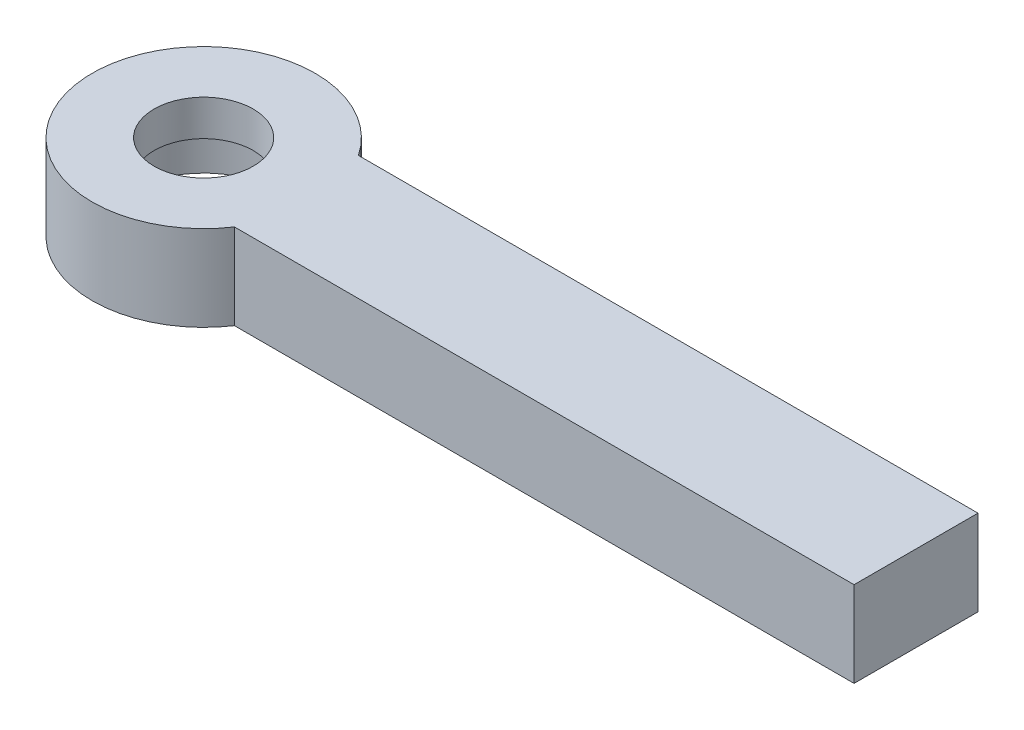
ISO-10303-21;
HEADER;
FILE_DESCRIPTION(('STEP AP214'),'2;1');
FILE_NAME('part.step','',(''),(''),'','','');
FILE_SCHEMA(('AUTOMOTIVE_DESIGN { 1 0 10303 214 1 1 1 1 }'));
ENDSEC;
DATA;
#1=APPLICATION_CONTEXT('core data for automotive mechanical design processes');
#2=APPLICATION_PROTOCOL_DEFINITION('international standard','automotive_design',2000,#1);
#3=PRODUCT_CONTEXT('',#1,'mechanical');
#4=PRODUCT('Part','Part','',(#3));
#5=PRODUCT_RELATED_PRODUCT_CATEGORY('part','',(#4));
#6=PRODUCT_DEFINITION_FORMATION('','',#4);
#7=PRODUCT_DEFINITION_CONTEXT('part definition',#1,'design');
#8=PRODUCT_DEFINITION('design','',#6,#7);
#9=PRODUCT_DEFINITION_SHAPE('','',#8);
#10=(LENGTH_UNIT() NAMED_UNIT(*) SI_UNIT(.MILLI.,.METRE.));
#11=(NAMED_UNIT(*) PLANE_ANGLE_UNIT() SI_UNIT($,.RADIAN.));
#12=(NAMED_UNIT(*) SI_UNIT($,.STERADIAN.) SOLID_ANGLE_UNIT());
#13=UNCERTAINTY_MEASURE_WITH_UNIT(LENGTH_MEASURE(1.E-05),#10,'distance_accuracy_value','');
#14=(GEOMETRIC_REPRESENTATION_CONTEXT(3) GLOBAL_UNCERTAINTY_ASSIGNED_CONTEXT((#13)) GLOBAL_UNIT_ASSIGNED_CONTEXT((#10,
#11,#12)) REPRESENTATION_CONTEXT('',''));
#15=CARTESIAN_POINT('',(0.,0.,0.));
#16=DIRECTION('',(0.,0.,1.));
#17=DIRECTION('',(1.,0.,0.));
#18=AXIS2_PLACEMENT_3D('',#15,#16,#17);
#19=CARTESIAN_POINT('',(0.,8.763,0.));
#20=DIRECTION('',(0.,-1.,0.));
#21=DIRECTION('',(0.,0.,-1.));
#22=AXIS2_PLACEMENT_3D('',#19,#20,#21);
#23=CYLINDRICAL_SURFACE('',#22,5.08);
#24=CARTESIAN_POINT('',(0.,8.763,0.));
#25=DIRECTION('',(0.,1.,0.));
#26=DIRECTION('',(0.,0.,1.));
#27=AXIS2_PLACEMENT_3D('',#24,#25,#26);
#28=CIRCLE('',#27,5.08);
#29=CARTESIAN_POINT('',(0.,8.763,5.08));
#30=VERTEX_POINT('',#29);
#31=EDGE_CURVE('E102',#30,#30,#28,.T.);
#32=ORIENTED_EDGE('',*,*,#31,.T.);
#33=EDGE_LOOP('',(#32));
#34=FACE_BOUND('',#33,.T.);
#35=CARTESIAN_POINT('',(0.,5.08,0.));
#36=DIRECTION('',(0.,-1.,0.));
#37=DIRECTION('',(0.,0.,-1.));
#38=AXIS2_PLACEMENT_3D('',#35,#36,#37);
#39=CIRCLE('',#38,5.08);
#40=CARTESIAN_POINT('',(0.,5.08,-5.08));
#41=VERTEX_POINT('',#40);
#42=EDGE_CURVE('E36',#41,#41,#39,.T.);
#43=ORIENTED_EDGE('',*,*,#42,.T.);
#44=EDGE_LOOP('',(#43));
#45=FACE_BOUND('',#44,.T.);
#46=ADVANCED_FACE('F32',(#34,#45),#23,.F.);
#47=CARTESIAN_POINT('',(0.,8.763,0.));
#48=DIRECTION('',(0.,-1.,0.));
#49=DIRECTION('',(0.,0.,-1.));
#50=AXIS2_PLACEMENT_3D('',#47,#48,#49);
#51=PLANE('',#50);
#52=CARTESIAN_POINT('',(0.,8.763,0.));
#53=DIRECTION('',(0.,1.,0.));
#54=DIRECTION('',(0.,0.,-1.));
#55=AXIS2_PLACEMENT_3D('',#52,#53,#54);
#56=CIRCLE('',#55,11.43);
#57=CARTESIAN_POINT('',(9.50380976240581,8.763,-6.35));
#58=VERTEX_POINT('',#57);
#59=CARTESIAN_POINT('',(9.50380976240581,8.763,6.35));
#60=VERTEX_POINT('',#59);
#61=EDGE_CURVE('E86',#58,#60,#56,.T.);
#62=ORIENTED_EDGE('',*,*,#61,.T.);
#63=DIRECTION('',(1.,0.,0.));
#64=VECTOR('',#63,1.);
#65=CARTESIAN_POINT('',(9.50380976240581,8.763,6.35));
#66=LINE('',#65,#64);
#67=CARTESIAN_POINT('',(73.0038097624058,8.763,6.35));
#68=VERTEX_POINT('',#67);
#69=EDGE_CURVE('E80',#60,#68,#66,.T.);
#70=ORIENTED_EDGE('',*,*,#69,.T.);
#71=DIRECTION('',(0.,0.,-1.));
#72=VECTOR('',#71,1.);
#73=CARTESIAN_POINT('',(73.0038097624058,8.763,6.35));
#74=LINE('',#73,#72);
#75=CARTESIAN_POINT('',(73.0038097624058,8.763,-6.35));
#76=VERTEX_POINT('',#75);
#77=EDGE_CURVE('E84',#68,#76,#74,.T.);
#78=ORIENTED_EDGE('',*,*,#77,.T.);
#79=DIRECTION('',(-1.,0.,0.));
#80=VECTOR('',#79,1.);
#81=CARTESIAN_POINT('',(73.0038097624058,8.763,-6.35));
#82=LINE('',#81,#80);
#83=EDGE_CURVE('E50',#76,#58,#82,.T.);
#84=ORIENTED_EDGE('',*,*,#83,.T.);
#85=EDGE_LOOP('',(#62,#70,#78,#84));
#86=FACE_BOUND('',#85,.T.);
#87=ORIENTED_EDGE('',*,*,#31,.F.);
#88=EDGE_LOOP('',(#87));
#89=FACE_BOUND('',#88,.T.);
#90=ADVANCED_FACE('F81',(#86,#89),#51,.F.);
#91=CARTESIAN_POINT('',(0.,0.,0.));
#92=DIRECTION('',(0.,-1.,0.));
#93=DIRECTION('',(0.,0.,-1.));
#94=AXIS2_PLACEMENT_3D('',#91,#92,#93);
#95=PLANE('',#94);
#96=CARTESIAN_POINT('',(0.,0.,0.));
#97=DIRECTION('',(0.,-1.,0.));
#98=DIRECTION('',(0.,0.,-1.));
#99=AXIS2_PLACEMENT_3D('',#96,#97,#98);
#100=CIRCLE('',#99,7.9375);
#101=CARTESIAN_POINT('',(0.,0.,-7.9375));
#102=VERTEX_POINT('',#101);
#103=EDGE_CURVE('E115',#102,#102,#100,.T.);
#104=ORIENTED_EDGE('',*,*,#103,.F.);
#105=EDGE_LOOP('',(#104));
#106=FACE_BOUND('',#105,.T.);
#107=CARTESIAN_POINT('',(0.,0.,0.));
#108=DIRECTION('',(0.,1.,0.));
#109=DIRECTION('',(0.,0.,-1.));
#110=AXIS2_PLACEMENT_3D('',#107,#108,#109);
#111=CIRCLE('',#110,11.43);
#112=CARTESIAN_POINT('',(9.50380976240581,0.,-6.35));
#113=VERTEX_POINT('',#112);
#114=CARTESIAN_POINT('',(9.50380976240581,0.,6.35));
#115=VERTEX_POINT('',#114);
#116=EDGE_CURVE('E99',#113,#115,#111,.T.);
#117=ORIENTED_EDGE('',*,*,#116,.F.);
#118=DIRECTION('',(-1.,0.,0.));
#119=VECTOR('',#118,1.);
#120=CARTESIAN_POINT('',(73.0038097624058,0.,-6.35));
#121=LINE('',#120,#119);
#122=CARTESIAN_POINT('',(73.0038097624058,0.,-6.35));
#123=VERTEX_POINT('',#122);
#124=EDGE_CURVE('E73',#123,#113,#121,.T.);
#125=ORIENTED_EDGE('',*,*,#124,.F.);
#126=DIRECTION('',(0.,0.,-1.));
#127=VECTOR('',#126,1.);
#128=CARTESIAN_POINT('',(73.0038097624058,0.,6.35));
#129=LINE('',#128,#127);
#130=CARTESIAN_POINT('',(73.0038097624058,0.,6.35));
#131=VERTEX_POINT('',#130);
#132=EDGE_CURVE('E67',#131,#123,#129,.T.);
#133=ORIENTED_EDGE('',*,*,#132,.F.);
#134=DIRECTION('',(1.,0.,0.));
#135=VECTOR('',#134,1.);
#136=CARTESIAN_POINT('',(9.50380976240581,0.,6.35));
#137=LINE('',#136,#135);
#138=EDGE_CURVE('E90',#115,#131,#137,.T.);
#139=ORIENTED_EDGE('',*,*,#138,.F.);
#140=EDGE_LOOP('',(#117,#125,#133,#139));
#141=FACE_BOUND('',#140,.T.);
#142=ADVANCED_FACE('F110',(#106,#141),#95,.T.);
#143=CARTESIAN_POINT('',(0.,8.763,0.));
#144=DIRECTION('',(0.,-1.,0.));
#145=DIRECTION('',(0.,0.,-1.));
#146=AXIS2_PLACEMENT_3D('',#143,#144,#145);
#147=CYLINDRICAL_SURFACE('',#146,11.43);
#148=ORIENTED_EDGE('',*,*,#116,.T.);
#149=DIRECTION('',(0.,-1.,0.));
#150=VECTOR('',#149,1.);
#151=CARTESIAN_POINT('',(9.50380976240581,8.763,6.35));
#152=LINE('',#151,#150);
#153=EDGE_CURVE('E11',#60,#115,#152,.T.);
#154=ORIENTED_EDGE('',*,*,#153,.F.);
#155=ORIENTED_EDGE('',*,*,#61,.F.);
#156=DIRECTION('',(0.,-1.,0.));
#157=VECTOR('',#156,1.);
#158=CARTESIAN_POINT('',(9.50380976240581,8.763,-6.35));
#159=LINE('',#158,#157);
#160=EDGE_CURVE('E95',#58,#113,#159,.T.);
#161=ORIENTED_EDGE('',*,*,#160,.T.);
#162=EDGE_LOOP('',(#148,#154,#155,#161));
#163=FACE_BOUND('',#162,.T.);
#164=ADVANCED_FACE('F34',(#163),#147,.T.);
#165=CARTESIAN_POINT('',(9.50380976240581,8.763,6.35));
#166=DIRECTION('',(0.,0.,-1.));
#167=DIRECTION('',(-1.,0.,0.));
#168=AXIS2_PLACEMENT_3D('',#165,#166,#167);
#169=PLANE('',#168);
#170=ORIENTED_EDGE('',*,*,#138,.T.);
#171=DIRECTION('',(0.,-1.,0.));
#172=VECTOR('',#171,1.);
#173=CARTESIAN_POINT('',(73.0038097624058,8.763,6.35));
#174=LINE('',#173,#172);
#175=EDGE_CURVE('E42',#68,#131,#174,.T.);
#176=ORIENTED_EDGE('',*,*,#175,.F.);
#177=ORIENTED_EDGE('',*,*,#69,.F.);
#178=ORIENTED_EDGE('',*,*,#153,.T.);
#179=EDGE_LOOP('',(#170,#176,#177,#178));
#180=FACE_BOUND('',#179,.T.);
#181=ADVANCED_FACE('F89',(#180),#169,.F.);
#182=CARTESIAN_POINT('',(73.0038097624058,8.763,6.35));
#183=DIRECTION('',(-1.,0.,0.));
#184=DIRECTION('',(0.,0.,1.));
#185=AXIS2_PLACEMENT_3D('',#182,#183,#184);
#186=PLANE('',#185);
#187=ORIENTED_EDGE('',*,*,#132,.T.);
#188=DIRECTION('',(0.,-1.,0.));
#189=VECTOR('',#188,1.);
#190=CARTESIAN_POINT('',(73.0038097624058,8.763,-6.35));
#191=LINE('',#190,#189);
#192=EDGE_CURVE('E91',#76,#123,#191,.T.);
#193=ORIENTED_EDGE('',*,*,#192,.F.);
#194=ORIENTED_EDGE('',*,*,#77,.F.);
#195=ORIENTED_EDGE('',*,*,#175,.T.);
#196=EDGE_LOOP('',(#187,#193,#194,#195));
#197=FACE_BOUND('',#196,.T.);
#198=ADVANCED_FACE('F93',(#197),#186,.F.);
#199=CARTESIAN_POINT('',(73.0038097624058,8.763,-6.35));
#200=DIRECTION('',(0.,0.,1.));
#201=DIRECTION('',(1.,0.,0.));
#202=AXIS2_PLACEMENT_3D('',#199,#200,#201);
#203=PLANE('',#202);
#204=ORIENTED_EDGE('',*,*,#124,.T.);
#205=ORIENTED_EDGE('',*,*,#160,.F.);
#206=ORIENTED_EDGE('',*,*,#83,.F.);
#207=ORIENTED_EDGE('',*,*,#192,.T.);
#208=EDGE_LOOP('',(#204,#205,#206,#207));
#209=FACE_BOUND('',#208,.T.);
#210=ADVANCED_FACE('F107',(#209),#203,.F.);
#211=CARTESIAN_POINT('',(0.,5.08,0.));
#212=DIRECTION('',(0.,-1.,0.));
#213=DIRECTION('',(0.,0.,-1.));
#214=AXIS2_PLACEMENT_3D('',#211,#212,#213);
#215=CYLINDRICAL_SURFACE('',#214,7.9375);
#216=CARTESIAN_POINT('',(0.,5.08,0.));
#217=DIRECTION('',(0.,-1.,0.));
#218=DIRECTION('',(0.,0.,-1.));
#219=AXIS2_PLACEMENT_3D('',#216,#217,#218);
#220=CIRCLE('',#219,7.9375);
#221=CARTESIAN_POINT('',(0.,5.08,-7.9375));
#222=VERTEX_POINT('',#221);
#223=EDGE_CURVE('E118',#222,#222,#220,.T.);
#224=ORIENTED_EDGE('',*,*,#223,.F.);
#225=EDGE_LOOP('',(#224));
#226=FACE_BOUND('',#225,.T.);
#227=ORIENTED_EDGE('',*,*,#103,.T.);
#228=EDGE_LOOP('',(#227));
#229=FACE_BOUND('',#228,.T.);
#230=ADVANCED_FACE('F128',(#226,#229),#215,.F.);
#231=CARTESIAN_POINT('',(0.,5.08,0.));
#232=DIRECTION('',(0.,-1.,0.));
#233=DIRECTION('',(0.,0.,-1.));
#234=AXIS2_PLACEMENT_3D('',#231,#232,#233);
#235=PLANE('',#234);
#236=ORIENTED_EDGE('',*,*,#42,.F.);
#237=EDGE_LOOP('',(#236));
#238=FACE_BOUND('',#237,.T.);
#239=ORIENTED_EDGE('',*,*,#223,.T.);
#240=EDGE_LOOP('',(#239));
#241=FACE_BOUND('',#240,.T.);
#242=ADVANCED_FACE('F126',(#238,#241),#235,.T.);
#243=CLOSED_SHELL('',(#46,#90,#142,#164,#181,#198,#210,#230,#242));
#244=MANIFOLD_SOLID_BREP('B2',#243);
#245=ADVANCED_BREP_SHAPE_REPRESENTATION('',(#18,#244),#14);
#246=SHAPE_DEFINITION_REPRESENTATION(#9,#245);
ENDSEC;
END-ISO-10303-21;
